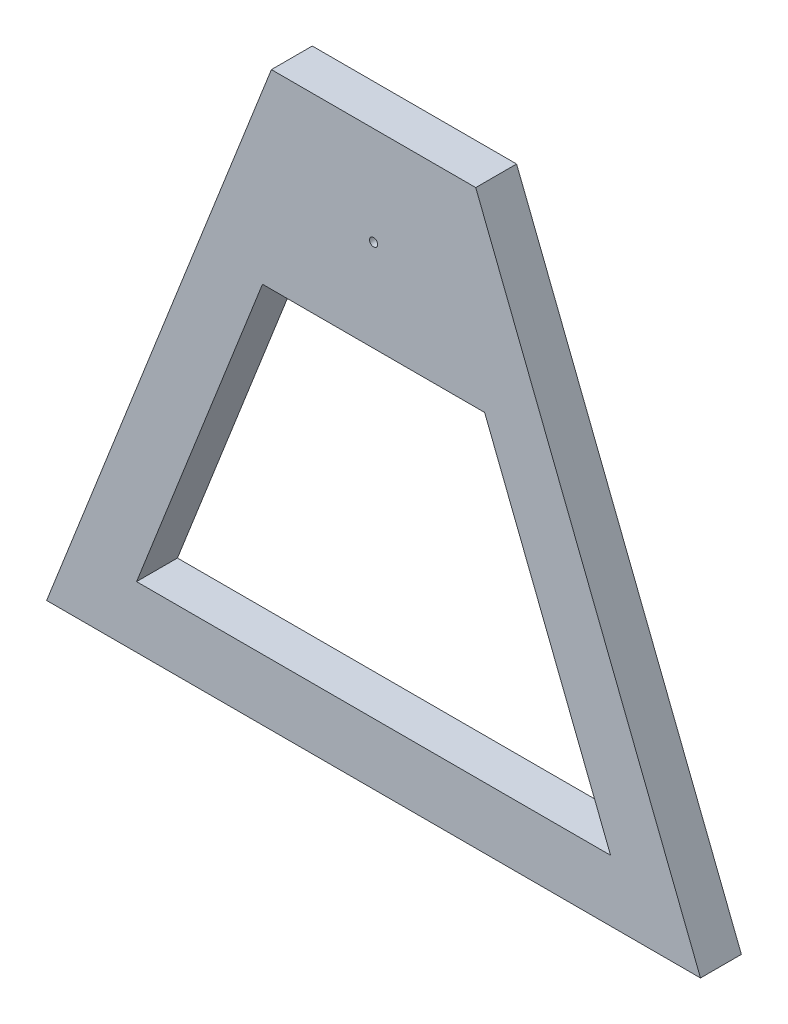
ISO-10303-21;
HEADER;
FILE_DESCRIPTION(('STEP AP214'),'2;1');
FILE_NAME('part.step','',(''),(''),'','','');
FILE_SCHEMA(('AUTOMOTIVE_DESIGN { 1 0 10303 214 1 1 1 1 }'));
ENDSEC;
DATA;
#1=APPLICATION_CONTEXT('core data for automotive mechanical design processes');
#2=APPLICATION_PROTOCOL_DEFINITION('international standard','automotive_design',2000,#1);
#3=PRODUCT_CONTEXT('',#1,'mechanical');
#4=PRODUCT('Part','Part','',(#3));
#5=PRODUCT_RELATED_PRODUCT_CATEGORY('part','',(#4));
#6=PRODUCT_DEFINITION_FORMATION('','',#4);
#7=PRODUCT_DEFINITION_CONTEXT('part definition',#1,'design');
#8=PRODUCT_DEFINITION('design','',#6,#7);
#9=PRODUCT_DEFINITION_SHAPE('','',#8);
#10=(LENGTH_UNIT() NAMED_UNIT(*) SI_UNIT(.MILLI.,.METRE.));
#11=(NAMED_UNIT(*) PLANE_ANGLE_UNIT() SI_UNIT($,.RADIAN.));
#12=(NAMED_UNIT(*) SI_UNIT($,.STERADIAN.) SOLID_ANGLE_UNIT());
#13=UNCERTAINTY_MEASURE_WITH_UNIT(LENGTH_MEASURE(1.E-05),#10,'distance_accuracy_value','');
#14=(GEOMETRIC_REPRESENTATION_CONTEXT(3) GLOBAL_UNCERTAINTY_ASSIGNED_CONTEXT((#13)) GLOBAL_UNIT_ASSIGNED_CONTEXT((#10,
#11,#12)) REPRESENTATION_CONTEXT('',''));
#15=CARTESIAN_POINT('',(0.,0.,0.));
#16=DIRECTION('',(0.,0.,1.));
#17=DIRECTION('',(1.,0.,0.));
#18=AXIS2_PLACEMENT_3D('',#15,#16,#17);
#19=CARTESIAN_POINT('',(0.,0.,100.));
#20=DIRECTION('',(0.,0.,1.));
#21=DIRECTION('',(1.,0.,0.));
#22=AXIS2_PLACEMENT_3D('',#19,#20,#21);
#23=PLANE('',#22);
#24=CARTESIAN_POINT('',(1.66533453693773E-13,1159.34,100.));
#25=DIRECTION('',(0.,0.,1.));
#26=DIRECTION('',(1.,0.,0.));
#27=AXIS2_PLACEMENT_3D('',#24,#25,#26);
#28=CIRCLE('',#27,9.99999999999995);
#29=CARTESIAN_POINT('',(10.0000000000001,1159.34,100.));
#30=VERTEX_POINT('',#29);
#31=EDGE_CURVE('E224',#30,#30,#28,.T.);
#32=ORIENTED_EDGE('',*,*,#31,.F.);
#33=EDGE_LOOP('',(#32));
#34=FACE_BOUND('',#33,.T.);
#35=DIRECTION('',(-0.365652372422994,-0.930751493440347,0.));
#36=VECTOR('',#35,1.);
#37=CARTESIAN_POINT('',(-250.,1400.,100.));
#38=LINE('',#37,#36);
#39=CARTESIAN_POINT('',(-250.,1400.,100.));
#40=VERTEX_POINT('',#39);
#41=CARTESIAN_POINT('',(-800.,0.,100.));
#42=VERTEX_POINT('',#41);
#43=EDGE_CURVE('E138',#40,#42,#38,.T.);
#44=ORIENTED_EDGE('',*,*,#43,.T.);
#45=DIRECTION('',(1.,0.,0.));
#46=VECTOR('',#45,1.);
#47=CARTESIAN_POINT('',(-800.,0.,100.));
#48=LINE('',#47,#46);
#49=CARTESIAN_POINT('',(800.,0.,100.));
#50=VERTEX_POINT('',#49);
#51=EDGE_CURVE('E141',#42,#50,#48,.T.);
#52=ORIENTED_EDGE('',*,*,#51,.T.);
#53=DIRECTION('',(-0.365652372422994,0.930751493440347,0.));
#54=VECTOR('',#53,1.);
#55=CARTESIAN_POINT('',(800.,0.,100.));
#56=LINE('',#55,#54);
#57=CARTESIAN_POINT('',(250.,1400.,100.));
#58=VERTEX_POINT('',#57);
#59=EDGE_CURVE('E144',#50,#58,#56,.T.);
#60=ORIENTED_EDGE('',*,*,#59,.T.);
#61=DIRECTION('',(-1.,0.,0.));
#62=VECTOR('',#61,1.);
#63=CARTESIAN_POINT('',(250.,1400.,100.));
#64=LINE('',#63,#62);
#65=EDGE_CURVE('E146',#58,#40,#64,.T.);
#66=ORIENTED_EDGE('',*,*,#65,.T.);
#67=EDGE_LOOP('',(#44,#52,#60,#66));
#68=FACE_BOUND('',#67,.T.);
#69=DIRECTION('',(-0.365652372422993,-0.930751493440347,0.));
#70=VECTOR('',#69,1.);
#71=CARTESIAN_POINT('',(-271.77776118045,934.34,100.));
#72=LINE('',#71,#70);
#73=CARTESIAN_POINT('',(-271.77776118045,934.34,100.));
#74=VERTEX_POINT('',#73);
#75=CARTESIAN_POINT('',(-579.911332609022,150.,100.));
#76=VERTEX_POINT('',#75);
#77=EDGE_CURVE('E108',#74,#76,#72,.T.);
#78=ORIENTED_EDGE('',*,*,#77,.F.);
#79=DIRECTION('',(-1.,0.,0.));
#80=VECTOR('',#79,1.);
#81=CARTESIAN_POINT('',(271.77776118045,934.34,100.));
#82=LINE('',#81,#80);
#83=CARTESIAN_POINT('',(271.77776118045,934.34,100.));
#84=VERTEX_POINT('',#83);
#85=EDGE_CURVE('E100',#84,#74,#82,.T.);
#86=ORIENTED_EDGE('',*,*,#85,.F.);
#87=DIRECTION('',(-0.365652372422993,0.930751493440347,0.));
#88=VECTOR('',#87,1.);
#89=CARTESIAN_POINT('',(579.911332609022,150.,100.));
#90=LINE('',#89,#88);
#91=CARTESIAN_POINT('',(579.911332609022,150.,100.));
#92=VERTEX_POINT('',#91);
#93=EDGE_CURVE('E122',#92,#84,#90,.T.);
#94=ORIENTED_EDGE('',*,*,#93,.F.);
#95=DIRECTION('',(1.,0.,0.));
#96=VECTOR('',#95,1.);
#97=CARTESIAN_POINT('',(-579.911332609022,150.,100.));
#98=LINE('',#97,#96);
#99=EDGE_CURVE('E120',#76,#92,#98,.T.);
#100=ORIENTED_EDGE('',*,*,#99,.F.);
#101=EDGE_LOOP('',(#78,#86,#94,#100));
#102=FACE_BOUND('',#101,.T.);
#103=ADVANCED_FACE('F35',(#34,#68,#102),#23,.T.);
#104=CARTESIAN_POINT('',(0.,0.,0.));
#105=DIRECTION('',(0.,0.,1.));
#106=DIRECTION('',(1.,0.,0.));
#107=AXIS2_PLACEMENT_3D('',#104,#105,#106);
#108=PLANE('',#107);
#109=CARTESIAN_POINT('',(1.66533453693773E-13,1159.34,0.));
#110=DIRECTION('',(0.,0.,1.));
#111=DIRECTION('',(1.,0.,0.));
#112=AXIS2_PLACEMENT_3D('',#109,#110,#111);
#113=CIRCLE('',#112,9.99999999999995);
#114=CARTESIAN_POINT('',(10.0000000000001,1159.34,0.));
#115=VERTEX_POINT('',#114);
#116=EDGE_CURVE('E128',#115,#115,#113,.F.);
#117=ORIENTED_EDGE('',*,*,#116,.F.);
#118=EDGE_LOOP('',(#117));
#119=FACE_BOUND('',#118,.T.);
#120=DIRECTION('',(-0.365652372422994,-0.930751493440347,0.));
#121=VECTOR('',#120,1.);
#122=CARTESIAN_POINT('',(-250.,1400.,0.));
#123=LINE('',#122,#121);
#124=CARTESIAN_POINT('',(-250.,1400.,0.));
#125=VERTEX_POINT('',#124);
#126=CARTESIAN_POINT('',(-800.,0.,0.));
#127=VERTEX_POINT('',#126);
#128=EDGE_CURVE('E116',#125,#127,#123,.T.);
#129=ORIENTED_EDGE('',*,*,#128,.F.);
#130=DIRECTION('',(-1.,0.,0.));
#131=VECTOR('',#130,1.);
#132=CARTESIAN_POINT('',(250.,1400.,0.));
#133=LINE('',#132,#131);
#134=CARTESIAN_POINT('',(250.,1400.,0.));
#135=VERTEX_POINT('',#134);
#136=EDGE_CURVE('E142',#135,#125,#133,.T.);
#137=ORIENTED_EDGE('',*,*,#136,.F.);
#138=DIRECTION('',(-0.365652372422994,0.930751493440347,0.));
#139=VECTOR('',#138,1.);
#140=CARTESIAN_POINT('',(800.,0.,0.));
#141=LINE('',#140,#139);
#142=CARTESIAN_POINT('',(800.,0.,0.));
#143=VERTEX_POINT('',#142);
#144=EDGE_CURVE('E153',#143,#135,#141,.T.);
#145=ORIENTED_EDGE('',*,*,#144,.F.);
#146=DIRECTION('',(1.,0.,0.));
#147=VECTOR('',#146,1.);
#148=CARTESIAN_POINT('',(-800.,0.,0.));
#149=LINE('',#148,#147);
#150=EDGE_CURVE('E151',#127,#143,#149,.T.);
#151=ORIENTED_EDGE('',*,*,#150,.F.);
#152=EDGE_LOOP('',(#129,#137,#145,#151));
#153=FACE_BOUND('',#152,.T.);
#154=DIRECTION('',(-1.,0.,0.));
#155=VECTOR('',#154,1.);
#156=CARTESIAN_POINT('',(271.77776118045,934.34,0.));
#157=LINE('',#156,#155);
#158=CARTESIAN_POINT('',(271.77776118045,934.34,0.));
#159=VERTEX_POINT('',#158);
#160=CARTESIAN_POINT('',(-271.77776118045,934.34,0.));
#161=VERTEX_POINT('',#160);
#162=EDGE_CURVE('E58',#159,#161,#157,.T.);
#163=ORIENTED_EDGE('',*,*,#162,.T.);
#164=DIRECTION('',(-0.365652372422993,-0.930751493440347,0.));
#165=VECTOR('',#164,1.);
#166=CARTESIAN_POINT('',(-271.77776118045,934.34,0.));
#167=LINE('',#166,#165);
#168=CARTESIAN_POINT('',(-579.911332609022,150.,0.));
#169=VERTEX_POINT('',#168);
#170=EDGE_CURVE('E115',#161,#169,#167,.T.);
#171=ORIENTED_EDGE('',*,*,#170,.T.);
#172=DIRECTION('',(1.,0.,0.));
#173=VECTOR('',#172,1.);
#174=CARTESIAN_POINT('',(-579.911332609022,150.,0.));
#175=LINE('',#174,#173);
#176=CARTESIAN_POINT('',(579.911332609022,150.,0.));
#177=VERTEX_POINT('',#176);
#178=EDGE_CURVE('E130',#169,#177,#175,.T.);
#179=ORIENTED_EDGE('',*,*,#178,.T.);
#180=DIRECTION('',(-0.365652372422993,0.930751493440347,0.));
#181=VECTOR('',#180,1.);
#182=CARTESIAN_POINT('',(579.911332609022,150.,0.));
#183=LINE('',#182,#181);
#184=EDGE_CURVE('E109',#177,#159,#183,.T.);
#185=ORIENTED_EDGE('',*,*,#184,.T.);
#186=EDGE_LOOP('',(#163,#171,#179,#185));
#187=FACE_BOUND('',#186,.T.);
#188=ADVANCED_FACE('F171',(#119,#153,#187),#108,.F.);
#189=CARTESIAN_POINT('',(-250.,1400.,100.));
#190=DIRECTION('',(0.930751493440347,-0.365652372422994,0.));
#191=DIRECTION('',(0.365652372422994,0.930751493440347,0.));
#192=AXIS2_PLACEMENT_3D('',#189,#190,#191);
#193=PLANE('',#192);
#194=ORIENTED_EDGE('',*,*,#128,.T.);
#195=DIRECTION('',(0.,0.,-1.));
#196=VECTOR('',#195,1.);
#197=CARTESIAN_POINT('',(-800.,0.,100.));
#198=LINE('',#197,#196);
#199=EDGE_CURVE('E11',#42,#127,#198,.T.);
#200=ORIENTED_EDGE('',*,*,#199,.F.);
#201=ORIENTED_EDGE('',*,*,#43,.F.);
#202=DIRECTION('',(0.,0.,-1.));
#203=VECTOR('',#202,1.);
#204=CARTESIAN_POINT('',(-250.,1400.,100.));
#205=LINE('',#204,#203);
#206=EDGE_CURVE('E148',#40,#125,#205,.T.);
#207=ORIENTED_EDGE('',*,*,#206,.T.);
#208=EDGE_LOOP('',(#194,#200,#201,#207));
#209=FACE_BOUND('',#208,.T.);
#210=ADVANCED_FACE('F37',(#209),#193,.F.);
#211=CARTESIAN_POINT('',(-800.,0.,100.));
#212=DIRECTION('',(0.,1.,0.));
#213=DIRECTION('',(0.,0.,1.));
#214=AXIS2_PLACEMENT_3D('',#211,#212,#213);
#215=PLANE('',#214);
#216=ORIENTED_EDGE('',*,*,#150,.T.);
#217=DIRECTION('',(0.,0.,-1.));
#218=VECTOR('',#217,1.);
#219=CARTESIAN_POINT('',(800.,0.,100.));
#220=LINE('',#219,#218);
#221=EDGE_CURVE('E43',#50,#143,#220,.T.);
#222=ORIENTED_EDGE('',*,*,#221,.F.);
#223=ORIENTED_EDGE('',*,*,#51,.F.);
#224=ORIENTED_EDGE('',*,*,#199,.T.);
#225=EDGE_LOOP('',(#216,#222,#223,#224));
#226=FACE_BOUND('',#225,.T.);
#227=ADVANCED_FACE('F181',(#226),#215,.F.);
#228=CARTESIAN_POINT('',(800.,0.,100.));
#229=DIRECTION('',(-0.930751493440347,-0.365652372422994,0.));
#230=DIRECTION('',(0.365652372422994,-0.930751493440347,0.));
#231=AXIS2_PLACEMENT_3D('',#228,#229,#230);
#232=PLANE('',#231);
#233=ORIENTED_EDGE('',*,*,#144,.T.);
#234=DIRECTION('',(0.,0.,-1.));
#235=VECTOR('',#234,1.);
#236=CARTESIAN_POINT('',(250.,1400.,100.));
#237=LINE('',#236,#235);
#238=EDGE_CURVE('E158',#58,#135,#237,.T.);
#239=ORIENTED_EDGE('',*,*,#238,.F.);
#240=ORIENTED_EDGE('',*,*,#59,.F.);
#241=ORIENTED_EDGE('',*,*,#221,.T.);
#242=EDGE_LOOP('',(#233,#239,#240,#241));
#243=FACE_BOUND('',#242,.T.);
#244=ADVANCED_FACE('F165',(#243),#232,.F.);
#245=CARTESIAN_POINT('',(250.,1400.,100.));
#246=DIRECTION('',(0.,-1.,0.));
#247=DIRECTION('',(0.,0.,-1.));
#248=AXIS2_PLACEMENT_3D('',#245,#246,#247);
#249=PLANE('',#248);
#250=ORIENTED_EDGE('',*,*,#136,.T.);
#251=ORIENTED_EDGE('',*,*,#206,.F.);
#252=ORIENTED_EDGE('',*,*,#65,.F.);
#253=ORIENTED_EDGE('',*,*,#238,.T.);
#254=EDGE_LOOP('',(#250,#251,#252,#253));
#255=FACE_BOUND('',#254,.T.);
#256=ADVANCED_FACE('F175',(#255),#249,.F.);
#257=CARTESIAN_POINT('',(271.77776118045,934.34,100.));
#258=DIRECTION('',(0.,-1.,0.));
#259=DIRECTION('',(1.,0.,0.));
#260=AXIS2_PLACEMENT_3D('',#257,#258,#259);
#261=PLANE('',#260);
#262=ORIENTED_EDGE('',*,*,#162,.F.);
#263=DIRECTION('',(0.,0.,-1.));
#264=VECTOR('',#263,1.);
#265=CARTESIAN_POINT('',(271.77776118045,934.34,100.));
#266=LINE('',#265,#264);
#267=EDGE_CURVE('E104',#84,#159,#266,.T.);
#268=ORIENTED_EDGE('',*,*,#267,.F.);
#269=ORIENTED_EDGE('',*,*,#85,.T.);
#270=DIRECTION('',(0.,0.,-1.));
#271=VECTOR('',#270,1.);
#272=CARTESIAN_POINT('',(-271.77776118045,934.34,100.));
#273=LINE('',#272,#271);
#274=EDGE_CURVE('E103',#74,#161,#273,.T.);
#275=ORIENTED_EDGE('',*,*,#274,.T.);
#276=EDGE_LOOP('',(#262,#268,#269,#275));
#277=FACE_BOUND('',#276,.T.);
#278=ADVANCED_FACE('F102',(#277),#261,.T.);
#279=CARTESIAN_POINT('',(-271.77776118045,934.34,100.));
#280=DIRECTION('',(0.930751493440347,-0.365652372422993,0.));
#281=DIRECTION('',(0.365652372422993,0.930751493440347,0.));
#282=AXIS2_PLACEMENT_3D('',#279,#280,#281);
#283=PLANE('',#282);
#284=ORIENTED_EDGE('',*,*,#170,.F.);
#285=ORIENTED_EDGE('',*,*,#274,.F.);
#286=ORIENTED_EDGE('',*,*,#77,.T.);
#287=DIRECTION('',(0.,0.,-1.));
#288=VECTOR('',#287,1.);
#289=CARTESIAN_POINT('',(-579.911332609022,150.,100.));
#290=LINE('',#289,#288);
#291=EDGE_CURVE('E117',#76,#169,#290,.T.);
#292=ORIENTED_EDGE('',*,*,#291,.T.);
#293=EDGE_LOOP('',(#284,#285,#286,#292));
#294=FACE_BOUND('',#293,.T.);
#295=ADVANCED_FACE('F112',(#294),#283,.T.);
#296=CARTESIAN_POINT('',(-579.911332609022,150.,100.));
#297=DIRECTION('',(0.,1.,0.));
#298=DIRECTION('',(-1.,0.,0.));
#299=AXIS2_PLACEMENT_3D('',#296,#297,#298);
#300=PLANE('',#299);
#301=ORIENTED_EDGE('',*,*,#178,.F.);
#302=ORIENTED_EDGE('',*,*,#291,.F.);
#303=ORIENTED_EDGE('',*,*,#99,.T.);
#304=DIRECTION('',(0.,0.,-1.));
#305=VECTOR('',#304,1.);
#306=CARTESIAN_POINT('',(579.911332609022,150.,100.));
#307=LINE('',#306,#305);
#308=EDGE_CURVE('E50',#92,#177,#307,.T.);
#309=ORIENTED_EDGE('',*,*,#308,.T.);
#310=EDGE_LOOP('',(#301,#302,#303,#309));
#311=FACE_BOUND('',#310,.T.);
#312=ADVANCED_FACE('F207',(#311),#300,.T.);
#313=CARTESIAN_POINT('',(579.911332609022,150.,100.));
#314=DIRECTION('',(-0.930751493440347,-0.365652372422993,0.));
#315=DIRECTION('',(0.365652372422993,-0.930751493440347,0.));
#316=AXIS2_PLACEMENT_3D('',#313,#314,#315);
#317=PLANE('',#316);
#318=ORIENTED_EDGE('',*,*,#184,.F.);
#319=ORIENTED_EDGE('',*,*,#308,.F.);
#320=ORIENTED_EDGE('',*,*,#93,.T.);
#321=ORIENTED_EDGE('',*,*,#267,.T.);
#322=EDGE_LOOP('',(#318,#319,#320,#321));
#323=FACE_BOUND('',#322,.T.);
#324=ADVANCED_FACE('F211',(#323),#317,.T.);
#325=CARTESIAN_POINT('',(1.66533453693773E-13,1159.34,-0.001000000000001));
#326=DIRECTION('',(0.,0.,1.));
#327=DIRECTION('',(1.,0.,0.));
#328=AXIS2_PLACEMENT_3D('',#325,#326,#327);
#329=CYLINDRICAL_SURFACE('',#328,9.99999999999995);
#330=ORIENTED_EDGE('',*,*,#31,.T.);
#331=EDGE_LOOP('',(#330));
#332=FACE_BOUND('',#331,.T.);
#333=ORIENTED_EDGE('',*,*,#116,.T.);
#334=EDGE_LOOP('',(#333));
#335=FACE_BOUND('',#334,.T.);
#336=ADVANCED_FACE('F217',(#332,#335),#329,.F.);
#337=CLOSED_SHELL('',(#103,#188,#210,#227,#244,#256,#278,#295,#312,#324,#336));
#338=MANIFOLD_SOLID_BREP('B2',#337);
#339=ADVANCED_BREP_SHAPE_REPRESENTATION('',(#18,#338),#14);
#340=SHAPE_DEFINITION_REPRESENTATION(#9,#339);
ENDSEC;
END-ISO-10303-21;
